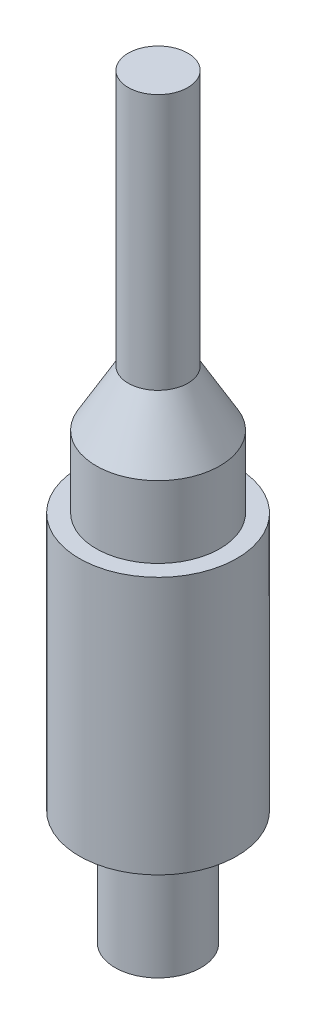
from build123d import *


with BuildPart() as part:
    # Sketch1 → Revolve1 (revolve)
    with BuildSketch(Plane.XY, mode=Mode.PRIVATE) as revolve1_sk:
        Polygon((0, -12.7), (4.7625, -12.7), (4.7625, 0), (8.7376, 0), (8.7376, 28.575), (6.858, 28.575), (6.858, 36.5252), (3.303858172, 42.681154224), (3.303858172, 71.072468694), (0, 71.072468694), align=None)
    revolve(revolve1_sk.sketch.rotate(Axis((0, -12.933071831, 0), (0, 1, 0)), 90), axis=Axis((0, -12.933071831, 0), (0, 1, 0)))


solid = part.part
